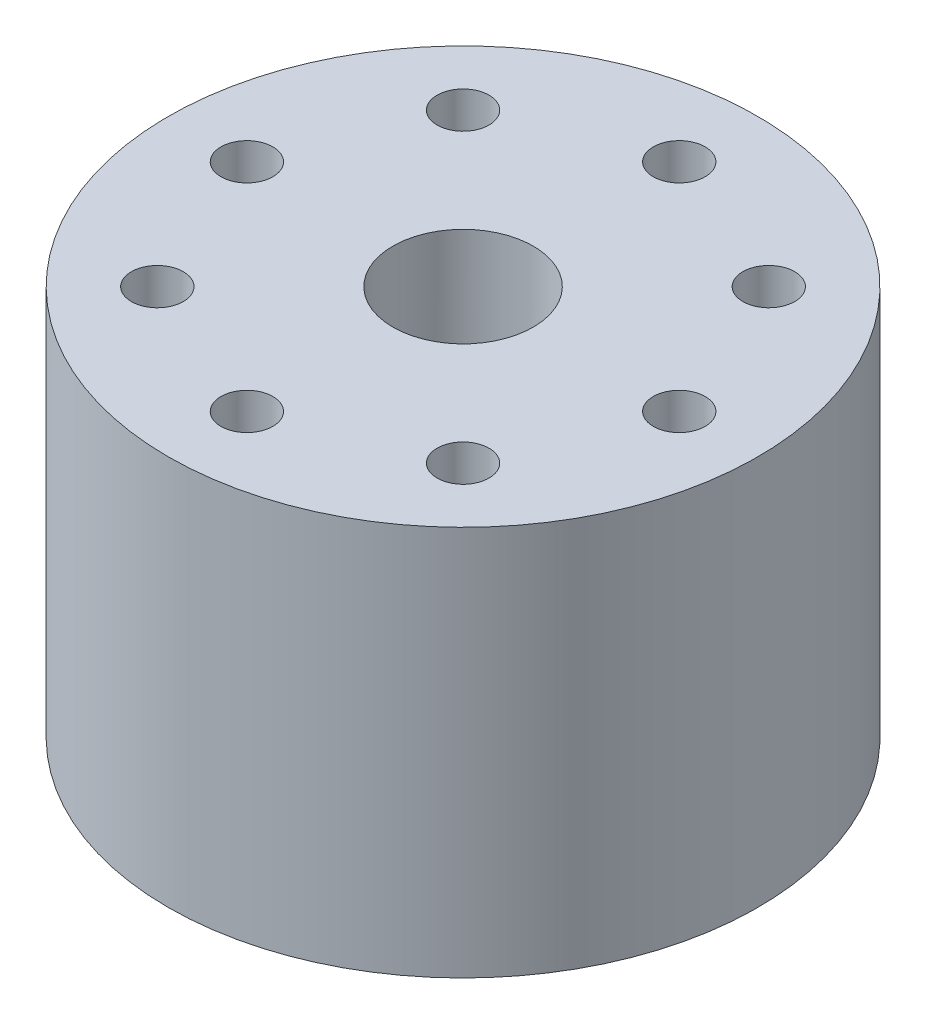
ISO-10303-21;
HEADER;
FILE_DESCRIPTION(('STEP AP214'),'2;1');
FILE_NAME('part.step','',(''),(''),'','','');
FILE_SCHEMA(('AUTOMOTIVE_DESIGN { 1 0 10303 214 1 1 1 1 }'));
ENDSEC;
DATA;
#1=APPLICATION_CONTEXT('core data for automotive mechanical design processes');
#2=APPLICATION_PROTOCOL_DEFINITION('international standard','automotive_design',2000,#1);
#3=PRODUCT_CONTEXT('',#1,'mechanical');
#4=PRODUCT('Part','Part','',(#3));
#5=PRODUCT_RELATED_PRODUCT_CATEGORY('part','',(#4));
#6=PRODUCT_DEFINITION_FORMATION('','',#4);
#7=PRODUCT_DEFINITION_CONTEXT('part definition',#1,'design');
#8=PRODUCT_DEFINITION('design','',#6,#7);
#9=PRODUCT_DEFINITION_SHAPE('','',#8);
#10=(LENGTH_UNIT() NAMED_UNIT(*) SI_UNIT(.MILLI.,.METRE.));
#11=(NAMED_UNIT(*) PLANE_ANGLE_UNIT() SI_UNIT($,.RADIAN.));
#12=(NAMED_UNIT(*) SI_UNIT($,.STERADIAN.) SOLID_ANGLE_UNIT());
#13=UNCERTAINTY_MEASURE_WITH_UNIT(LENGTH_MEASURE(1.E-05),#10,'distance_accuracy_value','');
#14=(GEOMETRIC_REPRESENTATION_CONTEXT(3) GLOBAL_UNCERTAINTY_ASSIGNED_CONTEXT((#13)) GLOBAL_UNIT_ASSIGNED_CONTEXT((#10,
#11,#12)) REPRESENTATION_CONTEXT('',''));
#15=CARTESIAN_POINT('',(0.,0.,0.));
#16=DIRECTION('',(0.,0.,1.));
#17=DIRECTION('',(1.,0.,0.));
#18=AXIS2_PLACEMENT_3D('',#15,#16,#17);
#19=CARTESIAN_POINT('',(0.,49.65,0.));
#20=DIRECTION('',(0.,-1.,0.));
#21=DIRECTION('',(0.,0.,-1.));
#22=AXIS2_PLACEMENT_3D('',#19,#20,#21);
#23=CYLINDRICAL_SURFACE('',#22,37.5);
#24=CARTESIAN_POINT('',(0.,49.65,0.));
#25=DIRECTION('',(0.,1.,0.));
#26=DIRECTION('',(0.,0.,1.));
#27=AXIS2_PLACEMENT_3D('',#24,#25,#26);
#28=CIRCLE('',#27,37.5);
#29=CARTESIAN_POINT('',(0.,49.65,37.5));
#30=VERTEX_POINT('',#29);
#31=EDGE_CURVE('E54',#30,#30,#28,.T.);
#32=ORIENTED_EDGE('',*,*,#31,.F.);
#33=EDGE_LOOP('',(#32));
#34=FACE_BOUND('',#33,.T.);
#35=CARTESIAN_POINT('',(0.,0.,0.));
#36=DIRECTION('',(0.,1.,0.));
#37=DIRECTION('',(0.,0.,1.));
#38=AXIS2_PLACEMENT_3D('',#35,#36,#37);
#39=CIRCLE('',#38,37.5);
#40=CARTESIAN_POINT('',(0.,0.,37.5));
#41=VERTEX_POINT('',#40);
#42=EDGE_CURVE('E58',#41,#41,#39,.T.);
#43=ORIENTED_EDGE('',*,*,#42,.T.);
#44=EDGE_LOOP('',(#43));
#45=FACE_BOUND('',#44,.T.);
#46=ADVANCED_FACE('F43',(#34,#45),#23,.T.);
#47=CARTESIAN_POINT('',(0.,49.65,0.));
#48=DIRECTION('',(0.,1.,0.));
#49=DIRECTION('',(0.,0.,1.));
#50=AXIS2_PLACEMENT_3D('',#47,#48,#49);
#51=PLANE('',#50);
#52=CARTESIAN_POINT('',(0.,49.65,27.5));
#53=DIRECTION('',(0.,1.,0.));
#54=DIRECTION('',(0.,0.,1.));
#55=AXIS2_PLACEMENT_3D('',#52,#53,#54);
#56=CIRCLE('',#55,3.3);
#57=CARTESIAN_POINT('',(0.,49.65,30.8));
#58=VERTEX_POINT('',#57);
#59=EDGE_CURVE('E273',#58,#58,#56,.T.);
#60=ORIENTED_EDGE('',*,*,#59,.F.);
#61=EDGE_LOOP('',(#60));
#62=FACE_BOUND('',#61,.T.);
#63=CARTESIAN_POINT('',(-19.4454364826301,49.65,19.44543648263));
#64=DIRECTION('',(0.,1.,0.));
#65=DIRECTION('',(0.,0.,1.));
#66=AXIS2_PLACEMENT_3D('',#63,#64,#65);
#67=CIRCLE('',#66,3.3);
#68=CARTESIAN_POINT('',(-19.4454364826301,49.65,22.74543648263));
#69=VERTEX_POINT('',#68);
#70=EDGE_CURVE('E279',#69,#69,#67,.T.);
#71=ORIENTED_EDGE('',*,*,#70,.F.);
#72=EDGE_LOOP('',(#71));
#73=FACE_BOUND('',#72,.T.);
#74=CARTESIAN_POINT('',(-27.5,49.65,0.));
#75=DIRECTION('',(0.,1.,0.));
#76=DIRECTION('',(0.,0.,1.));
#77=AXIS2_PLACEMENT_3D('',#74,#75,#76);
#78=CIRCLE('',#77,3.3);
#79=CARTESIAN_POINT('',(-27.5,49.65,3.2999999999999));
#80=VERTEX_POINT('',#79);
#81=EDGE_CURVE('E290',#80,#80,#78,.T.);
#82=ORIENTED_EDGE('',*,*,#81,.F.);
#83=EDGE_LOOP('',(#82));
#84=FACE_BOUND('',#83,.T.);
#85=CARTESIAN_POINT('',(-19.44543648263,49.65,-19.4454364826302));
#86=DIRECTION('',(0.,1.,0.));
#87=DIRECTION('',(0.,0.,1.));
#88=AXIS2_PLACEMENT_3D('',#85,#86,#87);
#89=CIRCLE('',#88,3.3);
#90=CARTESIAN_POINT('',(-19.44543648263,49.65,-16.1454364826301));
#91=VERTEX_POINT('',#90);
#92=EDGE_CURVE('E296',#91,#91,#89,.T.);
#93=ORIENTED_EDGE('',*,*,#92,.F.);
#94=EDGE_LOOP('',(#93));
#95=FACE_BOUND('',#94,.T.);
#96=CARTESIAN_POINT('',(1.92031473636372E-13,49.65,-27.5));
#97=DIRECTION('',(0.,1.,0.));
#98=DIRECTION('',(0.,0.,1.));
#99=AXIS2_PLACEMENT_3D('',#96,#97,#98);
#100=CIRCLE('',#99,3.3);
#101=CARTESIAN_POINT('',(1.92031473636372E-13,49.65,-24.2));
#102=VERTEX_POINT('',#101);
#103=EDGE_CURVE('E302',#102,#102,#100,.T.);
#104=ORIENTED_EDGE('',*,*,#103,.F.);
#105=EDGE_LOOP('',(#104));
#106=FACE_BOUND('',#105,.T.);
#107=CARTESIAN_POINT('',(19.4454364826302,49.65,-19.4454364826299));
#108=DIRECTION('',(0.,1.,0.));
#109=DIRECTION('',(0.,0.,1.));
#110=AXIS2_PLACEMENT_3D('',#107,#108,#109);
#111=CIRCLE('',#110,3.3);
#112=CARTESIAN_POINT('',(19.4454364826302,49.65,-16.1454364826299));
#113=VERTEX_POINT('',#112);
#114=EDGE_CURVE('E331',#113,#113,#111,.T.);
#115=ORIENTED_EDGE('',*,*,#114,.F.);
#116=EDGE_LOOP('',(#115));
#117=FACE_BOUND('',#116,.T.);
#118=CARTESIAN_POINT('',(27.5,49.65,2.88047210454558E-13));
#119=DIRECTION('',(0.,1.,0.));
#120=DIRECTION('',(0.,0.,1.));
#121=AXIS2_PLACEMENT_3D('',#118,#119,#120);
#122=CIRCLE('',#121,3.3);
#123=CARTESIAN_POINT('',(27.5,49.65,3.30000000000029));
#124=VERTEX_POINT('',#123);
#125=EDGE_CURVE('E338',#124,#124,#122,.T.);
#126=ORIENTED_EDGE('',*,*,#125,.F.);
#127=EDGE_LOOP('',(#126));
#128=FACE_BOUND('',#127,.T.);
#129=CARTESIAN_POINT('',(19.4454364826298,49.65,19.4454364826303));
#130=DIRECTION('',(0.,1.,0.));
#131=DIRECTION('',(0.,0.,1.));
#132=AXIS2_PLACEMENT_3D('',#129,#130,#131);
#133=CIRCLE('',#132,3.3);
#134=CARTESIAN_POINT('',(19.4454364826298,49.65,22.7454364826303));
#135=VERTEX_POINT('',#134);
#136=EDGE_CURVE('E274',#135,#135,#133,.T.);
#137=ORIENTED_EDGE('',*,*,#136,.F.);
#138=EDGE_LOOP('',(#137));
#139=FACE_BOUND('',#138,.T.);
#140=CARTESIAN_POINT('',(0.,49.65,0.));
#141=DIRECTION('',(0.,1.,0.));
#142=DIRECTION('',(0.,0.,1.));
#143=AXIS2_PLACEMENT_3D('',#140,#141,#142);
#144=CIRCLE('',#143,8.93);
#145=CARTESIAN_POINT('',(0.,49.65,8.93));
#146=VERTEX_POINT('',#145);
#147=EDGE_CURVE('E62',#146,#146,#144,.T.);
#148=ORIENTED_EDGE('',*,*,#147,.F.);
#149=EDGE_LOOP('',(#148));
#150=FACE_BOUND('',#149,.T.);
#151=ORIENTED_EDGE('',*,*,#31,.T.);
#152=EDGE_LOOP('',(#151));
#153=FACE_BOUND('',#152,.T.);
#154=ADVANCED_FACE('F104',(#62,#73,#84,#95,#106,#117,#128,#139,#150,#153),#51,.T.);
#155=CARTESIAN_POINT('',(0.,0.,0.));
#156=DIRECTION('',(0.,1.,0.));
#157=DIRECTION('',(0.,0.,1.));
#158=AXIS2_PLACEMENT_3D('',#155,#156,#157);
#159=PLANE('',#158);
#160=CARTESIAN_POINT('',(0.,0.,27.5));
#161=DIRECTION('',(0.,1.,0.));
#162=DIRECTION('',(0.,0.,1.));
#163=AXIS2_PLACEMENT_3D('',#160,#161,#162);
#164=CIRCLE('',#163,3.3);
#165=CARTESIAN_POINT('',(0.,0.,30.8));
#166=VERTEX_POINT('',#165);
#167=EDGE_CURVE('E270',#166,#166,#164,.T.);
#168=ORIENTED_EDGE('',*,*,#167,.T.);
#169=EDGE_LOOP('',(#168));
#170=FACE_BOUND('',#169,.T.);
#171=CARTESIAN_POINT('',(-19.4454364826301,0.,19.44543648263));
#172=DIRECTION('',(0.,1.,0.));
#173=DIRECTION('',(0.,0.,1.));
#174=AXIS2_PLACEMENT_3D('',#171,#172,#173);
#175=CIRCLE('',#174,3.3);
#176=CARTESIAN_POINT('',(-19.4454364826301,0.,22.74543648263));
#177=VERTEX_POINT('',#176);
#178=EDGE_CURVE('E287',#177,#177,#175,.T.);
#179=ORIENTED_EDGE('',*,*,#178,.T.);
#180=EDGE_LOOP('',(#179));
#181=FACE_BOUND('',#180,.T.);
#182=CARTESIAN_POINT('',(-27.5,0.,0.));
#183=DIRECTION('',(0.,1.,0.));
#184=DIRECTION('',(0.,0.,1.));
#185=AXIS2_PLACEMENT_3D('',#182,#183,#184);
#186=CIRCLE('',#185,3.3);
#187=CARTESIAN_POINT('',(-27.5,0.,3.2999999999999));
#188=VERTEX_POINT('',#187);
#189=EDGE_CURVE('E293',#188,#188,#186,.T.);
#190=ORIENTED_EDGE('',*,*,#189,.T.);
#191=EDGE_LOOP('',(#190));
#192=FACE_BOUND('',#191,.T.);
#193=CARTESIAN_POINT('',(-19.44543648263,0.,-19.4454364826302));
#194=DIRECTION('',(0.,1.,0.));
#195=DIRECTION('',(0.,0.,1.));
#196=AXIS2_PLACEMENT_3D('',#193,#194,#195);
#197=CIRCLE('',#196,3.3);
#198=CARTESIAN_POINT('',(-19.44543648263,0.,-16.1454364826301));
#199=VERTEX_POINT('',#198);
#200=EDGE_CURVE('E299',#199,#199,#197,.T.);
#201=ORIENTED_EDGE('',*,*,#200,.T.);
#202=EDGE_LOOP('',(#201));
#203=FACE_BOUND('',#202,.T.);
#204=CARTESIAN_POINT('',(1.92031473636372E-13,0.,-27.5));
#205=DIRECTION('',(0.,1.,0.));
#206=DIRECTION('',(0.,0.,1.));
#207=AXIS2_PLACEMENT_3D('',#204,#205,#206);
#208=CIRCLE('',#207,3.3);
#209=CARTESIAN_POINT('',(1.92031473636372E-13,0.,-24.2));
#210=VERTEX_POINT('',#209);
#211=EDGE_CURVE('E326',#210,#210,#208,.T.);
#212=ORIENTED_EDGE('',*,*,#211,.T.);
#213=EDGE_LOOP('',(#212));
#214=FACE_BOUND('',#213,.T.);
#215=CARTESIAN_POINT('',(19.4454364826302,0.,-19.4454364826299));
#216=DIRECTION('',(0.,1.,0.));
#217=DIRECTION('',(0.,0.,1.));
#218=AXIS2_PLACEMENT_3D('',#215,#216,#217);
#219=CIRCLE('',#218,3.3);
#220=CARTESIAN_POINT('',(19.4454364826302,0.,-16.1454364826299));
#221=VERTEX_POINT('',#220);
#222=EDGE_CURVE('E336',#221,#221,#219,.T.);
#223=ORIENTED_EDGE('',*,*,#222,.T.);
#224=EDGE_LOOP('',(#223));
#225=FACE_BOUND('',#224,.T.);
#226=CARTESIAN_POINT('',(27.5,0.,2.88047210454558E-13));
#227=DIRECTION('',(0.,1.,0.));
#228=DIRECTION('',(0.,0.,1.));
#229=AXIS2_PLACEMENT_3D('',#226,#227,#228);
#230=CIRCLE('',#229,3.3);
#231=CARTESIAN_POINT('',(27.5,0.,3.30000000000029));
#232=VERTEX_POINT('',#231);
#233=EDGE_CURVE('E282',#232,#232,#230,.T.);
#234=ORIENTED_EDGE('',*,*,#233,.T.);
#235=EDGE_LOOP('',(#234));
#236=FACE_BOUND('',#235,.T.);
#237=CARTESIAN_POINT('',(19.4454364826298,0.,19.4454364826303));
#238=DIRECTION('',(0.,1.,0.));
#239=DIRECTION('',(0.,0.,1.));
#240=AXIS2_PLACEMENT_3D('',#237,#238,#239);
#241=CIRCLE('',#240,3.3);
#242=CARTESIAN_POINT('',(19.4454364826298,0.,22.7454364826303));
#243=VERTEX_POINT('',#242);
#244=EDGE_CURVE('E277',#243,#243,#241,.T.);
#245=ORIENTED_EDGE('',*,*,#244,.T.);
#246=EDGE_LOOP('',(#245));
#247=FACE_BOUND('',#246,.T.);
#248=CARTESIAN_POINT('',(0.,0.,0.));
#249=DIRECTION('',(0.,-1.,0.));
#250=DIRECTION('',(0.,0.,-1.));
#251=AXIS2_PLACEMENT_3D('',#248,#249,#250);
#252=CIRCLE('',#251,16.);
#253=CARTESIAN_POINT('',(0.,0.,-16.));
#254=VERTEX_POINT('',#253);
#255=EDGE_CURVE('E67',#254,#254,#252,.T.);
#256=ORIENTED_EDGE('',*,*,#255,.F.);
#257=EDGE_LOOP('',(#256));
#258=FACE_BOUND('',#257,.T.);
#259=ORIENTED_EDGE('',*,*,#42,.F.);
#260=EDGE_LOOP('',(#259));
#261=FACE_BOUND('',#260,.T.);
#262=ADVANCED_FACE('F103',(#170,#181,#192,#203,#214,#225,#236,#247,#258,#261),#159,.F.);
#263=CARTESIAN_POINT('',(0.,26.65,0.));
#264=DIRECTION('',(0.,1.,0.));
#265=DIRECTION('',(0.,0.,1.));
#266=AXIS2_PLACEMENT_3D('',#263,#264,#265);
#267=CYLINDRICAL_SURFACE('',#266,8.93);
#268=CARTESIAN_POINT('',(0.,31.8461524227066,0.));
#269=DIRECTION('',(0.,1.,0.));
#270=DIRECTION('',(0.,0.,1.));
#271=AXIS2_PLACEMENT_3D('',#268,#269,#270);
#272=CIRCLE('',#271,8.93);
#273=CARTESIAN_POINT('',(0.,31.8461524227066,-8.93));
#274=VERTEX_POINT('',#273);
#275=EDGE_CURVE('E11',#274,#274,#272,.F.);
#276=ORIENTED_EDGE('',*,*,#275,.T.);
#277=EDGE_LOOP('',(#276));
#278=FACE_BOUND('',#277,.T.);
#279=ORIENTED_EDGE('',*,*,#147,.T.);
#280=EDGE_LOOP('',(#279));
#281=FACE_BOUND('',#280,.T.);
#282=ADVANCED_FACE('F96',(#278,#281),#267,.F.);
#283=CARTESIAN_POINT('',(0.,3.15,0.));
#284=DIRECTION('',(0.,-1.,0.));
#285=DIRECTION('',(0.,0.,-1.));
#286=AXIS2_PLACEMENT_3D('',#283,#284,#285);
#287=PLANE('',#286);
#288=CARTESIAN_POINT('',(0.,3.15,0.));
#289=DIRECTION('',(0.,-1.,0.));
#290=DIRECTION('',(0.,0.,-1.));
#291=AXIS2_PLACEMENT_3D('',#288,#289,#290);
#292=CIRCLE('',#291,16.);
#293=CARTESIAN_POINT('',(0.,3.15,-16.));
#294=VERTEX_POINT('',#293);
#295=EDGE_CURVE('E66',#294,#294,#292,.T.);
#296=ORIENTED_EDGE('',*,*,#295,.T.);
#297=EDGE_LOOP('',(#296));
#298=FACE_BOUND('',#297,.T.);
#299=CARTESIAN_POINT('',(0.,3.15,0.));
#300=DIRECTION('',(0.,-1.,0.));
#301=DIRECTION('',(0.,0.,-1.));
#302=AXIS2_PLACEMENT_3D('',#299,#300,#301);
#303=CIRCLE('',#302,12.);
#304=CARTESIAN_POINT('',(0.,3.15,-12.));
#305=VERTEX_POINT('',#304);
#306=EDGE_CURVE('E70',#305,#305,#303,.T.);
#307=ORIENTED_EDGE('',*,*,#306,.F.);
#308=EDGE_LOOP('',(#307));
#309=FACE_BOUND('',#308,.T.);
#310=ADVANCED_FACE('F93',(#298,#309),#287,.T.);
#311=CARTESIAN_POINT('',(0.,3.15,0.));
#312=DIRECTION('',(0.,-1.,0.));
#313=DIRECTION('',(0.,0.,-1.));
#314=AXIS2_PLACEMENT_3D('',#311,#312,#313);
#315=CYLINDRICAL_SURFACE('',#314,16.);
#316=ORIENTED_EDGE('',*,*,#295,.F.);
#317=EDGE_LOOP('',(#316));
#318=FACE_BOUND('',#317,.T.);
#319=ORIENTED_EDGE('',*,*,#255,.T.);
#320=EDGE_LOOP('',(#319));
#321=FACE_BOUND('',#320,.T.);
#322=ADVANCED_FACE('F90',(#318,#321),#315,.F.);
#323=CARTESIAN_POINT('',(-12.,20.19,0.));
#324=CARTESIAN_POINT('',(-19.2,11.67,0.));
#325=CARTESIAN_POINT('',(-12.,3.15,0.));
#326=B_SPLINE_CURVE_WITH_KNOTS('',2,(#323,#324,#325),.UNSPECIFIED.,.F.,.F.,(3,3),(0.,1.),.UNSPECIFIED.);
#327=CARTESIAN_POINT('',(0.,3.15,0.));
#328=DIRECTION('',(0.,-1.,0.));
#329=AXIS1_PLACEMENT('',#327,#328);
#330=SURFACE_OF_REVOLUTION('',#326,#329);
#331=ORIENTED_EDGE('',*,*,#306,.T.);
#332=EDGE_LOOP('',(#331));
#333=FACE_BOUND('',#332,.T.);
#334=CARTESIAN_POINT('',(0.,20.19,0.));
#335=DIRECTION('',(0.,1.,0.));
#336=DIRECTION('',(-1.,0.,0.));
#337=AXIS2_PLACEMENT_3D('',#334,#335,#336);
#338=CIRCLE('',#337,12.);
#339=CARTESIAN_POINT('',(-12.,20.19,0.));
#340=VERTEX_POINT('',#339);
#341=EDGE_CURVE('E75',#340,#340,#338,.T.);
#342=ORIENTED_EDGE('',*,*,#341,.T.);
#343=EDGE_LOOP('',(#342));
#344=FACE_BOUND('',#343,.T.);
#345=ADVANCED_FACE('F85',(#333,#344),#330,.F.);
#346=CARTESIAN_POINT('',(-12.,26.65,0.));
#347=DIRECTION('',(0.,1.,0.));
#348=DIRECTION('',(-1.,0.,0.));
#349=AXIS2_PLACEMENT_3D('',#346,#347,#348);
#350=PLANE('',#349);
#351=CARTESIAN_POINT('',(0.,26.65,0.));
#352=DIRECTION('',(0.,1.,0.));
#353=DIRECTION('',(-1.,0.,0.));
#354=AXIS2_PLACEMENT_3D('',#351,#352,#353);
#355=CIRCLE('',#354,11.93);
#356=CARTESIAN_POINT('',(0.,26.65,-11.93));
#357=VERTEX_POINT('',#356);
#358=EDGE_CURVE('E50',#357,#357,#355,.T.);
#359=ORIENTED_EDGE('',*,*,#358,.T.);
#360=EDGE_LOOP('',(#359));
#361=FACE_BOUND('',#360,.T.);
#362=CARTESIAN_POINT('',(0.,26.65,0.));
#363=DIRECTION('',(0.,1.,0.));
#364=DIRECTION('',(-1.,0.,0.));
#365=AXIS2_PLACEMENT_3D('',#362,#363,#364);
#366=CIRCLE('',#365,12.);
#367=CARTESIAN_POINT('',(-12.,26.65,0.));
#368=VERTEX_POINT('',#367);
#369=EDGE_CURVE('E304',#368,#368,#366,.T.);
#370=ORIENTED_EDGE('',*,*,#369,.F.);
#371=EDGE_LOOP('',(#370));
#372=FACE_BOUND('',#371,.T.);
#373=ADVANCED_FACE('F89',(#361,#372),#350,.F.);
#374=CARTESIAN_POINT('',(0.,26.65,0.));
#375=DIRECTION('',(0.,1.,0.));
#376=DIRECTION('',(-1.,0.,0.));
#377=AXIS2_PLACEMENT_3D('',#374,#375,#376);
#378=CYLINDRICAL_SURFACE('',#377,12.);
#379=ORIENTED_EDGE('',*,*,#341,.F.);
#380=EDGE_LOOP('',(#379));
#381=FACE_BOUND('',#380,.T.);
#382=ORIENTED_EDGE('',*,*,#369,.T.);
#383=EDGE_LOOP('',(#382));
#384=FACE_BOUND('',#383,.T.);
#385=ADVANCED_FACE('F152',(#381,#384),#378,.F.);
#386=CARTESIAN_POINT('',(19.4454364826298,0.,19.4454364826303));
#387=DIRECTION('',(0.,1.,0.));
#388=DIRECTION('',(0.,0.,1.));
#389=AXIS2_PLACEMENT_3D('',#386,#387,#388);
#390=CYLINDRICAL_SURFACE('',#389,3.3);
#391=ORIENTED_EDGE('',*,*,#244,.F.);
#392=EDGE_LOOP('',(#391));
#393=FACE_BOUND('',#392,.T.);
#394=ORIENTED_EDGE('',*,*,#136,.T.);
#395=EDGE_LOOP('',(#394));
#396=FACE_BOUND('',#395,.T.);
#397=ADVANCED_FACE('F158',(#393,#396),#390,.F.);
#398=CARTESIAN_POINT('',(27.5,0.,2.88047210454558E-13));
#399=DIRECTION('',(0.,1.,0.));
#400=DIRECTION('',(0.,0.,1.));
#401=AXIS2_PLACEMENT_3D('',#398,#399,#400);
#402=CYLINDRICAL_SURFACE('',#401,3.3);
#403=ORIENTED_EDGE('',*,*,#125,.T.);
#404=EDGE_LOOP('',(#403));
#405=FACE_BOUND('',#404,.T.);
#406=ORIENTED_EDGE('',*,*,#233,.F.);
#407=EDGE_LOOP('',(#406));
#408=FACE_BOUND('',#407,.T.);
#409=ADVANCED_FACE('F164',(#405,#408),#402,.F.);
#410=CARTESIAN_POINT('',(19.4454364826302,0.,-19.4454364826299));
#411=DIRECTION('',(0.,1.,0.));
#412=DIRECTION('',(0.,0.,1.));
#413=AXIS2_PLACEMENT_3D('',#410,#411,#412);
#414=CYLINDRICAL_SURFACE('',#413,3.3);
#415=ORIENTED_EDGE('',*,*,#222,.F.);
#416=EDGE_LOOP('',(#415));
#417=FACE_BOUND('',#416,.T.);
#418=ORIENTED_EDGE('',*,*,#114,.T.);
#419=EDGE_LOOP('',(#418));
#420=FACE_BOUND('',#419,.T.);
#421=ADVANCED_FACE('F172',(#417,#420),#414,.F.);
#422=CARTESIAN_POINT('',(1.92031473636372E-13,0.,-27.5));
#423=DIRECTION('',(0.,1.,0.));
#424=DIRECTION('',(0.,0.,1.));
#425=AXIS2_PLACEMENT_3D('',#422,#423,#424);
#426=CYLINDRICAL_SURFACE('',#425,3.3);
#427=ORIENTED_EDGE('',*,*,#211,.F.);
#428=EDGE_LOOP('',(#427));
#429=FACE_BOUND('',#428,.T.);
#430=ORIENTED_EDGE('',*,*,#103,.T.);
#431=EDGE_LOOP('',(#430));
#432=FACE_BOUND('',#431,.T.);
#433=ADVANCED_FACE('F180',(#429,#432),#426,.F.);
#434=CARTESIAN_POINT('',(-19.44543648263,0.,-19.4454364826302));
#435=DIRECTION('',(0.,1.,0.));
#436=DIRECTION('',(0.,0.,1.));
#437=AXIS2_PLACEMENT_3D('',#434,#435,#436);
#438=CYLINDRICAL_SURFACE('',#437,3.3);
#439=ORIENTED_EDGE('',*,*,#200,.F.);
#440=EDGE_LOOP('',(#439));
#441=FACE_BOUND('',#440,.T.);
#442=ORIENTED_EDGE('',*,*,#92,.T.);
#443=EDGE_LOOP('',(#442));
#444=FACE_BOUND('',#443,.T.);
#445=ADVANCED_FACE('F188',(#441,#444),#438,.F.);
#446=CARTESIAN_POINT('',(-27.5,0.,0.));
#447=DIRECTION('',(0.,1.,0.));
#448=DIRECTION('',(0.,0.,1.));
#449=AXIS2_PLACEMENT_3D('',#446,#447,#448);
#450=CYLINDRICAL_SURFACE('',#449,3.3);
#451=ORIENTED_EDGE('',*,*,#189,.F.);
#452=EDGE_LOOP('',(#451));
#453=FACE_BOUND('',#452,.T.);
#454=ORIENTED_EDGE('',*,*,#81,.T.);
#455=EDGE_LOOP('',(#454));
#456=FACE_BOUND('',#455,.T.);
#457=ADVANCED_FACE('F196',(#453,#456),#450,.F.);
#458=CARTESIAN_POINT('',(-19.4454364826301,0.,19.44543648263));
#459=DIRECTION('',(0.,1.,0.));
#460=DIRECTION('',(0.,0.,1.));
#461=AXIS2_PLACEMENT_3D('',#458,#459,#460);
#462=CYLINDRICAL_SURFACE('',#461,3.3);
#463=ORIENTED_EDGE('',*,*,#178,.F.);
#464=EDGE_LOOP('',(#463));
#465=FACE_BOUND('',#464,.T.);
#466=ORIENTED_EDGE('',*,*,#70,.T.);
#467=EDGE_LOOP('',(#466));
#468=FACE_BOUND('',#467,.T.);
#469=ADVANCED_FACE('F204',(#465,#468),#462,.F.);
#470=CARTESIAN_POINT('',(0.,0.,27.5));
#471=DIRECTION('',(0.,1.,0.));
#472=DIRECTION('',(0.,0.,1.));
#473=AXIS2_PLACEMENT_3D('',#470,#471,#472);
#474=CYLINDRICAL_SURFACE('',#473,3.3);
#475=ORIENTED_EDGE('',*,*,#167,.F.);
#476=EDGE_LOOP('',(#475));
#477=FACE_BOUND('',#476,.T.);
#478=ORIENTED_EDGE('',*,*,#59,.T.);
#479=EDGE_LOOP('',(#478));
#480=FACE_BOUND('',#479,.T.);
#481=ADVANCED_FACE('F212',(#477,#480),#474,.F.);
#482=CARTESIAN_POINT('',(0.,26.65,0.));
#483=DIRECTION('',(0.,-1.,0.));
#484=DIRECTION('',(0.,0.,-1.));
#485=AXIS2_PLACEMENT_3D('',#482,#483,#484);
#486=CONICAL_SURFACE('',#485,11.93,0.5235987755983);
#487=CARTESIAN_POINT('',(0.,31.8461524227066,-8.93));
#488=CARTESIAN_POINT('',(0.,31.7920258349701,-8.96125));
#489=CARTESIAN_POINT('',(0.,31.7378992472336,-8.9925));
#490=CARTESIAN_POINT('',(0.,31.6296460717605,-9.055));
#491=CARTESIAN_POINT('',(0.,31.575519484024,-9.08625));
#492=CARTESIAN_POINT('',(0.,31.4672663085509,-9.14875));
#493=CARTESIAN_POINT('',(0.,31.4131397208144,-9.18));
#494=CARTESIAN_POINT('',(0.,31.3048865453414,-9.2425));
#495=CARTESIAN_POINT('',(0.,31.2507599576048,-9.27375));
#496=CARTESIAN_POINT('',(0.,31.1425067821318,-9.33625));
#497=CARTESIAN_POINT('',(0.,31.0883801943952,-9.36750000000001));
#498=CARTESIAN_POINT('',(0.,30.9801270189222,-9.43000000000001));
#499=CARTESIAN_POINT('',(0.,30.9260004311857,-9.46125000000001));
#500=CARTESIAN_POINT('',(0.,30.8177472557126,-9.52375000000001));
#501=CARTESIAN_POINT('',(0.,30.7636206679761,-9.55500000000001));
#502=CARTESIAN_POINT('',(0.,30.655367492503,-9.61750000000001));
#503=CARTESIAN_POINT('',(0.,30.6012409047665,-9.64875000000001));
#504=CARTESIAN_POINT('',(0.,30.4929877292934,-9.71125000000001));
#505=CARTESIAN_POINT('',(0.,30.4388611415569,-9.74250000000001));
#506=CARTESIAN_POINT('',(0.,30.3306079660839,-9.80500000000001));
#507=CARTESIAN_POINT('',(0.,30.2764813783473,-9.83625000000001));
#508=CARTESIAN_POINT('',(0.,30.1682282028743,-9.89875000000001));
#509=CARTESIAN_POINT('',(0.,30.1141016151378,-9.93000000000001));
#510=CARTESIAN_POINT('',(0.,30.0058484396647,-9.99250000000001));
#511=CARTESIAN_POINT('',(0.,29.9517218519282,-10.02375));
#512=CARTESIAN_POINT('',(0.,29.8434686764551,-10.08625));
#513=CARTESIAN_POINT('',(0.,29.7893420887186,-10.1175));
#514=CARTESIAN_POINT('',(0.,29.6810889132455,-10.18));
#515=CARTESIAN_POINT('',(0.,29.626962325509,-10.21125));
#516=CARTESIAN_POINT('',(0.,29.5187091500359,-10.27375));
#517=CARTESIAN_POINT('',(0.,29.4645825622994,-10.305));
#518=CARTESIAN_POINT('',(0.,29.3563293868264,-10.3675));
#519=CARTESIAN_POINT('',(0.,29.3022027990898,-10.39875));
#520=CARTESIAN_POINT('',(0.,29.1939496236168,-10.46125));
#521=CARTESIAN_POINT('',(0.,29.1398230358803,-10.4925));
#522=CARTESIAN_POINT('',(0.,29.0315698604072,-10.555));
#523=CARTESIAN_POINT('',(0.,28.9774432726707,-10.58625));
#524=CARTESIAN_POINT('',(0.,28.8691900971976,-10.64875));
#525=CARTESIAN_POINT('',(0.,28.8150635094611,-10.68));
#526=CARTESIAN_POINT('',(0.,28.706810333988,-10.7425));
#527=CARTESIAN_POINT('',(0.,28.6526837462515,-10.77375));
#528=CARTESIAN_POINT('',(0.,28.5444305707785,-10.83625));
#529=CARTESIAN_POINT('',(0.,28.4903039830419,-10.8675));
#530=CARTESIAN_POINT('',(0.,28.3820508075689,-10.93));
#531=CARTESIAN_POINT('',(0.,28.3279242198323,-10.96125));
#532=CARTESIAN_POINT('',(0.,28.2196710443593,-11.02375));
#533=CARTESIAN_POINT('',(0.,28.1655444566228,-11.055));
#534=CARTESIAN_POINT('',(0.,28.0572912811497,-11.1175));
#535=CARTESIAN_POINT('',(0.,28.0031646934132,-11.14875));
#536=CARTESIAN_POINT('',(0.,27.8949115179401,-11.21125));
#537=CARTESIAN_POINT('',(0.,27.8407849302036,-11.2425));
#538=CARTESIAN_POINT('',(0.,27.7325317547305,-11.305));
#539=CARTESIAN_POINT('',(0.,27.678405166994,-11.33625));
#540=CARTESIAN_POINT('',(0.,27.570151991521,-11.39875));
#541=CARTESIAN_POINT('',(0.,27.5160254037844,-11.43));
#542=CARTESIAN_POINT('',(0.,27.4077722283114,-11.4925));
#543=CARTESIAN_POINT('',(0.,27.3536456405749,-11.52375));
#544=CARTESIAN_POINT('',(0.,27.2453924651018,-11.58625));
#545=CARTESIAN_POINT('',(0.,27.1912658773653,-11.6175));
#546=CARTESIAN_POINT('',(0.,27.0830127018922,-11.68));
#547=CARTESIAN_POINT('',(0.,27.0288861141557,-11.71125));
#548=CARTESIAN_POINT('',(0.,26.9206329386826,-11.77375));
#549=CARTESIAN_POINT('',(0.,26.8665063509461,-11.805));
#550=CARTESIAN_POINT('',(0.,26.7582531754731,-11.8675));
#551=CARTESIAN_POINT('',(0.,26.7041265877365,-11.89875));
#552=CARTESIAN_POINT('',(0.,26.65,-11.93));
#553=B_SPLINE_CURVE_WITH_KNOTS('',3,(#487,#488,#489,#490,#491,#492,#493,#494,#495,#496,#497,
#498,#499,#500,#501,#502,#503,#504,#505,#506,#507,#508,#509,#510,#511,#512,#513,#514,#515,#516,
#517,#518,#519,#520,#521,#522,#523,#524,#525,#526,#527,#528,#529,#530,#531,#532,#533,#534,#535,
#536,#537,#538,#539,#540,#541,#542,#543,#544,#545,#546,#547,#548,#549,#550,#551,#552),
.UNSPECIFIED.,.F.,.F.,(4,2,2,2,2,2,2,2,2,2,2,2,2,2,2,2,2,2,2,2,2,2,2,2,2,2,2,2,2,2,2,2,4),(0.,
0.187500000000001,0.375000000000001,0.562500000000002,0.750000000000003,0.937500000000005,1.125,
1.3125,1.5,1.6875,1.875,2.0625,2.25,2.4375,2.625,2.8125,3.,3.1875,3.375,3.5625,3.75,3.9375,
4.125,4.3125,4.5,4.6875,4.875,5.0625,5.25000000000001,5.4375,5.625,5.81250000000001,6.),.UNSPECIFIED.);
#554=EDGE_CURVE('BSEAM45',#274,#357,#553,.T.);
#555=ORIENTED_EDGE('',*,*,#275,.F.);
#556=ORIENTED_EDGE('',*,*,#358,.F.);
#557=ORIENTED_EDGE('',*,*,#554,.T.);
#558=ORIENTED_EDGE('',*,*,#554,.F.);
#559=EDGE_LOOP('',(#555,#557,#556,#558));
#560=FACE_BOUND('',#559,.T.);
#561=ADVANCED_FACE('F45',(#560),#486,.F.);
#562=CLOSED_SHELL('',(#46,#154,#262,#282,#310,#322,#345,#373,#385,#397,#409,#421,#433,#445,#457,
#469,#481,#561));
#563=MANIFOLD_SOLID_BREP('B2',#562);
#564=ADVANCED_BREP_SHAPE_REPRESENTATION('',(#18,#563),#14);
#565=SHAPE_DEFINITION_REPRESENTATION(#9,#564);
ENDSEC;
END-ISO-10303-21;
